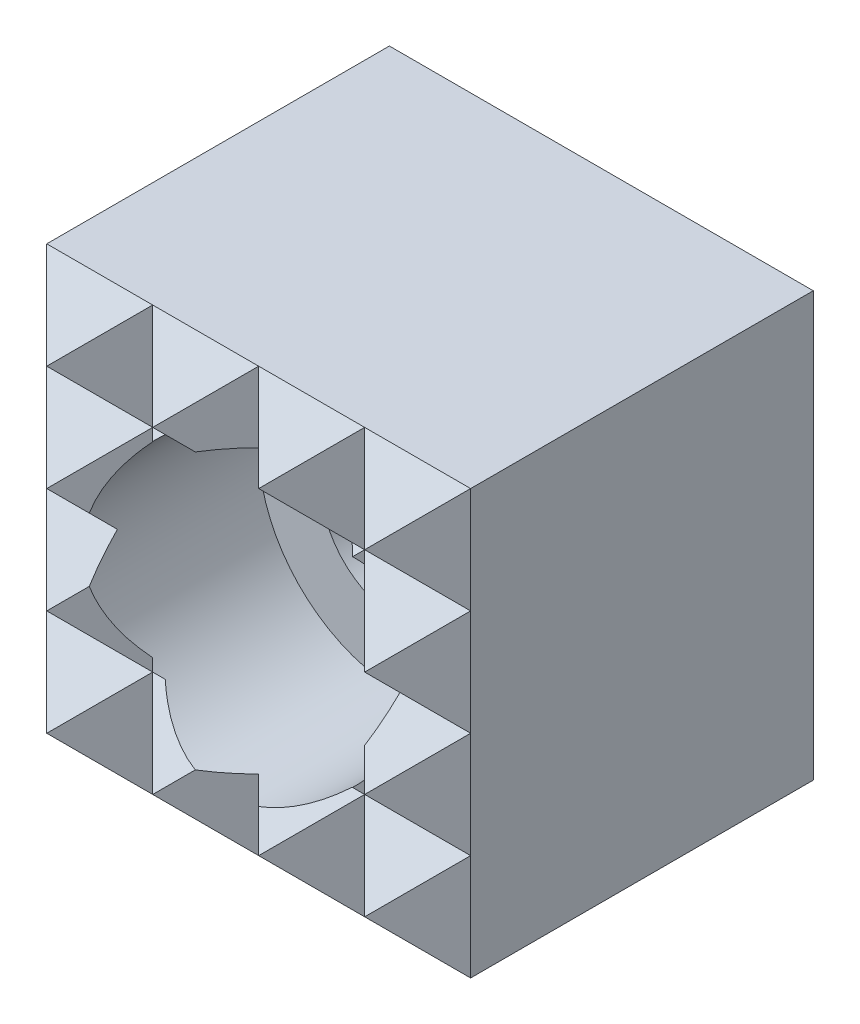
ISO-10303-21;
HEADER;
FILE_DESCRIPTION(('STEP AP214'),'2;1');
FILE_NAME('part.step','',(''),(''),'','','');
FILE_SCHEMA(('AUTOMOTIVE_DESIGN { 1 0 10303 214 1 1 1 1 }'));
ENDSEC;
DATA;
#1=APPLICATION_CONTEXT('core data for automotive mechanical design processes');
#2=APPLICATION_PROTOCOL_DEFINITION('international standard','automotive_design',2000,#1);
#3=PRODUCT_CONTEXT('',#1,'mechanical');
#4=PRODUCT('Part','Part','',(#3));
#5=PRODUCT_RELATED_PRODUCT_CATEGORY('part','',(#4));
#6=PRODUCT_DEFINITION_FORMATION('','',#4);
#7=PRODUCT_DEFINITION_CONTEXT('part definition',#1,'design');
#8=PRODUCT_DEFINITION('design','',#6,#7);
#9=PRODUCT_DEFINITION_SHAPE('','',#8);
#10=(LENGTH_UNIT() NAMED_UNIT(*) SI_UNIT(.MILLI.,.METRE.));
#11=(NAMED_UNIT(*) PLANE_ANGLE_UNIT() SI_UNIT($,.RADIAN.));
#12=(NAMED_UNIT(*) SI_UNIT($,.STERADIAN.) SOLID_ANGLE_UNIT());
#13=UNCERTAINTY_MEASURE_WITH_UNIT(LENGTH_MEASURE(1.E-05),#10,'distance_accuracy_value','');
#14=(GEOMETRIC_REPRESENTATION_CONTEXT(3) GLOBAL_UNCERTAINTY_ASSIGNED_CONTEXT((#13)) GLOBAL_UNIT_ASSIGNED_CONTEXT((#10,
#11,#12)) REPRESENTATION_CONTEXT('',''));
#15=CARTESIAN_POINT('',(0.,0.,0.));
#16=DIRECTION('',(0.,0.,1.));
#17=DIRECTION('',(1.,0.,0.));
#18=AXIS2_PLACEMENT_3D('',#15,#16,#17);
#19=CARTESIAN_POINT('',(-2.99999999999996,-10.,10.5));
#20=DIRECTION('',(0.707106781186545,0.,-0.70710678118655));
#21=DIRECTION('',(-0.70710678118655,0.,-0.707106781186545));
#22=AXIS2_PLACEMENT_3D('',#19,#20,#21);
#23=PLANE('',#22);
#24=DIRECTION('',(0.,1.,0.));
#25=VECTOR('',#24,1.);
#26=CARTESIAN_POINT('',(-2.99999999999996,-10.,10.5));
#27=LINE('',#26,#25);
#28=CARTESIAN_POINT('',(-2.99999999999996,-3.,10.5));
#29=VERTEX_POINT('',#28);
#30=CARTESIAN_POINT('',(-2.99999999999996,-2.64575131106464,10.5));
#31=VERTEX_POINT('',#30);
#32=EDGE_CURVE('E282',#29,#31,#27,.T.);
#33=ORIENTED_EDGE('',*,*,#32,.F.);
#34=DIRECTION('',(0.577350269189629,0.577350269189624,0.577350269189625));
#35=VECTOR('',#34,1.);
#36=CARTESIAN_POINT('',(-5.3333333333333,-5.33333333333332,8.16666666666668));
#37=LINE('',#36,#35);
#38=CARTESIAN_POINT('',(-2.82842712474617,-2.82842712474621,10.6715728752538));
#39=VERTEX_POINT('',#38);
#40=EDGE_CURVE('E400',#29,#39,#37,.T.);
#41=ORIENTED_EDGE('',*,*,#40,.T.);
#42=CARTESIAN_POINT('',(0.,0.,13.5));
#43=DIRECTION('',(0.707106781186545,0.,-0.70710678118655));
#44=DIRECTION('',(0.70710678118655,0.,0.707106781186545));
#45=AXIS2_PLACEMENT_3D('',#42,#43,#44);
#46=ELLIPSE('',#45,5.65685424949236,4.);
#47=EDGE_CURVE('E341',#39,#31,#46,.T.);
#48=ORIENTED_EDGE('',*,*,#47,.T.);
#49=EDGE_LOOP('',(#33,#41,#48));
#50=FACE_BOUND('',#49,.T.);
#51=ADVANCED_FACE('F14',(#50),#23,.F.);
#52=CARTESIAN_POINT('',(1.5,-10.,12.));
#53=DIRECTION('',(-0.707106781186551,0.,-0.707106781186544));
#54=DIRECTION('',(-0.707106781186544,0.,0.707106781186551));
#55=AXIS2_PLACEMENT_3D('',#52,#53,#54);
#56=PLANE('',#55);
#57=DIRECTION('',(0.,1.,0.));
#58=VECTOR('',#57,1.);
#59=CARTESIAN_POINT('',(3.,-10.,10.5));
#60=LINE('',#59,#58);
#61=CARTESIAN_POINT('',(3.,2.64575131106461,10.5));
#62=VERTEX_POINT('',#61);
#63=CARTESIAN_POINT('',(3.,3.,10.5));
#64=VERTEX_POINT('',#63);
#65=EDGE_CURVE('E702',#62,#64,#60,.T.);
#66=ORIENTED_EDGE('',*,*,#65,.T.);
#67=DIRECTION('',(-0.577350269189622,-0.577350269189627,0.577350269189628));
#68=VECTOR('',#67,1.);
#69=CARTESIAN_POINT('',(-2.33333333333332,-2.33333333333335,15.8333333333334));
#70=LINE('',#69,#68);
#71=CARTESIAN_POINT('',(2.82842712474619,2.8284271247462,10.6715728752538));
#72=VERTEX_POINT('',#71);
#73=EDGE_CURVE('E421',#64,#72,#70,.T.);
#74=ORIENTED_EDGE('',*,*,#73,.T.);
#75=CARTESIAN_POINT('',(0.,0.,13.5));
#76=DIRECTION('',(-0.707106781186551,0.,-0.707106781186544));
#77=DIRECTION('',(-0.707106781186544,0.,0.707106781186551));
#78=AXIS2_PLACEMENT_3D('',#75,#76,#77);
#79=ELLIPSE('',#78,5.65685424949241,4.);
#80=EDGE_CURVE('E353',#72,#62,#79,.T.);
#81=ORIENTED_EDGE('',*,*,#80,.T.);
#82=EDGE_LOOP('',(#66,#74,#81));
#83=FACE_BOUND('',#82,.T.);
#84=ADVANCED_FACE('F578',(#83),#56,.F.);
#85=CARTESIAN_POINT('',(-2.99999999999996,2.64575131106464,10.5));
#86=VERTEX_POINT('',#85);
#87=CARTESIAN_POINT('',(-2.82842712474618,2.82842712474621,10.6715728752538));
#88=VERTEX_POINT('',#87);
#89=EDGE_CURVE('E338',#86,#88,#46,.T.);
#90=ORIENTED_EDGE('',*,*,#89,.T.);
#91=DIRECTION('',(-0.577350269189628,0.577350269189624,-0.577350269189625));
#92=VECTOR('',#91,1.);
#93=CARTESIAN_POINT('',(1.33333333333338,-1.33333333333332,14.8333333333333));
#94=LINE('',#93,#92);
#95=CARTESIAN_POINT('',(-2.99999999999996,3.,10.5));
#96=VERTEX_POINT('',#95);
#97=EDGE_CURVE('E257',#88,#96,#94,.T.);
#98=ORIENTED_EDGE('',*,*,#97,.T.);
#99=EDGE_CURVE('E279',#86,#96,#27,.T.);
#100=ORIENTED_EDGE('',*,*,#99,.F.);
#101=EDGE_LOOP('',(#90,#98,#100));
#102=FACE_BOUND('',#101,.T.);
#103=ADVANCED_FACE('F575',(#102),#23,.F.);
#104=CARTESIAN_POINT('',(3.,-2.64575131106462,10.5));
#105=VERTEX_POINT('',#104);
#106=CARTESIAN_POINT('',(2.82842712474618,-2.8284271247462,10.6715728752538));
#107=VERTEX_POINT('',#106);
#108=EDGE_CURVE('E350',#105,#107,#79,.T.);
#109=ORIENTED_EDGE('',*,*,#108,.T.);
#110=DIRECTION('',(0.577350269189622,-0.577350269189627,-0.577350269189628));
#111=VECTOR('',#110,1.);
#112=CARTESIAN_POINT('',(4.33333333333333,-4.33333333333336,9.16666666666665));
#113=LINE('',#112,#111);
#114=CARTESIAN_POINT('',(3.,-3.,10.5));
#115=VERTEX_POINT('',#114);
#116=EDGE_CURVE('E465',#107,#115,#113,.T.);
#117=ORIENTED_EDGE('',*,*,#116,.T.);
#118=EDGE_CURVE('E704',#115,#105,#60,.T.);
#119=ORIENTED_EDGE('',*,*,#118,.T.);
#120=EDGE_LOOP('',(#109,#117,#119));
#121=FACE_BOUND('',#120,.T.);
#122=ADVANCED_FACE('F577',(#121),#56,.F.);
#123=CARTESIAN_POINT('',(3.,-10.,10.5));
#124=DIRECTION('',(0.707106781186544,0.,-0.707106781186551));
#125=DIRECTION('',(-0.707106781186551,0.,-0.707106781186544));
#126=AXIS2_PLACEMENT_3D('',#123,#124,#125);
#127=PLANE('',#126);
#128=DIRECTION('',(0.57735026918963,0.577350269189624,0.577350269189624));
#129=VECTOR('',#128,1.);
#130=CARTESIAN_POINT('',(0.666666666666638,-5.33333333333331,8.16666666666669));
#131=LINE('',#130,#129);
#132=CARTESIAN_POINT('',(4.49999999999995,-1.5,12.));
#133=VERTEX_POINT('',#132);
#134=EDGE_CURVE('E468',#115,#133,#131,.T.);
#135=ORIENTED_EDGE('',*,*,#134,.T.);
#136=DIRECTION('',(-0.57735026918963,0.577350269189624,-0.577350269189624));
#137=VECTOR('',#136,1.);
#138=CARTESIAN_POINT('',(6.33333333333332,-3.33333333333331,13.8333333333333));
#139=LINE('',#138,#137);
#140=CARTESIAN_POINT('',(3.89791576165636,-0.897915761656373,11.3979157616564));
#141=VERTEX_POINT('',#140);
#142=EDGE_CURVE('E453',#133,#141,#139,.T.);
#143=ORIENTED_EDGE('',*,*,#142,.T.);
#144=CARTESIAN_POINT('',(0.,0.,7.5));
#145=DIRECTION('',(0.707106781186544,0.,-0.707106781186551));
#146=DIRECTION('',(0.707106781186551,0.,0.707106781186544));
#147=AXIS2_PLACEMENT_3D('',#144,#145,#146);
#148=ELLIPSE('',#147,5.65685424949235,4.);
#149=EDGE_CURVE('E357',#141,#105,#148,.T.);
#150=ORIENTED_EDGE('',*,*,#149,.T.);
#151=ORIENTED_EDGE('',*,*,#118,.F.);
#152=EDGE_LOOP('',(#135,#143,#150,#151));
#153=FACE_BOUND('',#152,.T.);
#154=ADVANCED_FACE('F586',(#153),#127,.F.);
#155=CARTESIAN_POINT('',(3.89791576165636,0.897915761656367,11.3979157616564));
#156=VERTEX_POINT('',#155);
#157=EDGE_CURVE('E354',#62,#156,#148,.T.);
#158=ORIENTED_EDGE('',*,*,#157,.T.);
#159=DIRECTION('',(0.57735026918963,0.577350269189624,0.577350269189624));
#160=VECTOR('',#159,1.);
#161=CARTESIAN_POINT('',(-0.333333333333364,-3.33333333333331,7.16666666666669));
#162=LINE('',#161,#160);
#163=CARTESIAN_POINT('',(4.49999999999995,1.5,12.));
#164=VERTEX_POINT('',#163);
#165=EDGE_CURVE('E443',#156,#164,#162,.T.);
#166=ORIENTED_EDGE('',*,*,#165,.T.);
#167=DIRECTION('',(-0.57735026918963,0.577350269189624,-0.577350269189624));
#168=VECTOR('',#167,1.);
#169=CARTESIAN_POINT('',(7.33333333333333,-1.33333333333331,14.8333333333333));
#170=LINE('',#169,#168);
#171=EDGE_CURVE('E429',#164,#64,#170,.T.);
#172=ORIENTED_EDGE('',*,*,#171,.T.);
#173=ORIENTED_EDGE('',*,*,#65,.F.);
#174=EDGE_LOOP('',(#158,#166,#172,#173));
#175=FACE_BOUND('',#174,.T.);
#176=ADVANCED_FACE('F764',(#175),#127,.F.);
#177=CARTESIAN_POINT('',(4.5,-10.,12.));
#178=DIRECTION('',(-0.707106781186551,0.,-0.707106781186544));
#179=DIRECTION('',(-0.707106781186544,0.,0.707106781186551));
#180=AXIS2_PLACEMENT_3D('',#177,#178,#179);
#181=PLANE('',#180);
#182=DIRECTION('',(-0.577350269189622,-0.577350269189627,0.577350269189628));
#183=VECTOR('',#182,1.);
#184=CARTESIAN_POINT('',(2.66666666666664,-6.33333333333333,13.8333333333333));
#185=LINE('',#184,#183);
#186=CARTESIAN_POINT('',(6.,-3.,10.5));
#187=VERTEX_POINT('',#186);
#188=CARTESIAN_POINT('',(4.5,-4.5,12.));
#189=VERTEX_POINT('',#188);
#190=EDGE_CURVE('E486',#187,#189,#185,.T.);
#191=ORIENTED_EDGE('',*,*,#190,.T.);
#192=DIRECTION('',(0.577350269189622,-0.577350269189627,-0.577350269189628));
#193=VECTOR('',#192,1.);
#194=CARTESIAN_POINT('',(6.33333333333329,-6.33333333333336,10.1666666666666));
#195=LINE('',#194,#193);
#196=CARTESIAN_POINT('',(6.,-6.,10.5));
#197=VERTEX_POINT('',#196);
#198=EDGE_CURVE('E494',#189,#197,#195,.T.);
#199=ORIENTED_EDGE('',*,*,#198,.T.);
#200=DIRECTION('',(0.,1.,0.));
#201=VECTOR('',#200,1.);
#202=CARTESIAN_POINT('',(6.,-10.,10.5));
#203=LINE('',#202,#201);
#204=EDGE_CURVE('E277',#197,#187,#203,.T.);
#205=ORIENTED_EDGE('',*,*,#204,.T.);
#206=EDGE_LOOP('',(#191,#199,#205));
#207=FACE_BOUND('',#206,.T.);
#208=ADVANCED_FACE('F735',(#207),#181,.F.);
#209=DIRECTION('',(-0.577350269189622,-0.577350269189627,0.577350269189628));
#210=VECTOR('',#209,1.);
#211=CARTESIAN_POINT('',(1.66666666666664,-4.33333333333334,14.8333333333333));
#212=LINE('',#211,#210);
#213=CARTESIAN_POINT('',(6.,0.,10.5));
#214=VERTEX_POINT('',#213);
#215=EDGE_CURVE('E456',#214,#133,#212,.T.);
#216=ORIENTED_EDGE('',*,*,#215,.T.);
#217=DIRECTION('',(0.577350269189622,-0.577350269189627,-0.577350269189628));
#218=VECTOR('',#217,1.);
#219=CARTESIAN_POINT('',(7.33333333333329,-4.33333333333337,9.16666666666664));
#220=LINE('',#219,#218);
#221=EDGE_CURVE('E471',#133,#187,#220,.T.);
#222=ORIENTED_EDGE('',*,*,#221,.T.);
#223=EDGE_CURVE('E696',#187,#214,#203,.T.);
#224=ORIENTED_EDGE('',*,*,#223,.T.);
#225=EDGE_LOOP('',(#216,#222,#224));
#226=FACE_BOUND('',#225,.T.);
#227=ADVANCED_FACE('F776',(#226),#181,.F.);
#228=DIRECTION('',(-0.577350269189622,-0.577350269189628,0.577350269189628));
#229=VECTOR('',#228,1.);
#230=CARTESIAN_POINT('',(0.666666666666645,-2.33333333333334,15.8333333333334));
#231=LINE('',#230,#229);
#232=CARTESIAN_POINT('',(5.99999999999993,3.,10.5));
#233=VERTEX_POINT('',#232);
#234=EDGE_CURVE('E433',#233,#164,#231,.T.);
#235=ORIENTED_EDGE('',*,*,#234,.T.);
#236=DIRECTION('',(0.577350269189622,-0.577350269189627,-0.577350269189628));
#237=VECTOR('',#236,1.);
#238=CARTESIAN_POINT('',(8.33333333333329,-2.33333333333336,8.16666666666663));
#239=LINE('',#238,#237);
#240=EDGE_CURVE('E446',#164,#214,#239,.T.);
#241=ORIENTED_EDGE('',*,*,#240,.T.);
#242=EDGE_CURVE('E693',#214,#233,#203,.T.);
#243=ORIENTED_EDGE('',*,*,#242,.T.);
#244=EDGE_LOOP('',(#235,#241,#243));
#245=FACE_BOUND('',#244,.T.);
#246=ADVANCED_FACE('F695',(#245),#181,.F.);
#247=CARTESIAN_POINT('',(-6.,-10.,10.5));
#248=DIRECTION('',(0.707106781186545,0.,-0.70710678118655));
#249=DIRECTION('',(-0.70710678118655,0.,-0.707106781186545));
#250=AXIS2_PLACEMENT_3D('',#247,#248,#249);
#251=PLANE('',#250);
#252=DIRECTION('',(0.,1.,0.));
#253=VECTOR('',#252,1.);
#254=CARTESIAN_POINT('',(-6.,-10.,10.5));
#255=LINE('',#254,#253);
#256=CARTESIAN_POINT('',(-6.,-6.,10.5));
#257=VERTEX_POINT('',#256);
#258=CARTESIAN_POINT('',(-6.,-3.,10.5));
#259=VERTEX_POINT('',#258);
#260=EDGE_CURVE('E268',#257,#259,#255,.T.);
#261=ORIENTED_EDGE('',*,*,#260,.F.);
#262=DIRECTION('',(0.577350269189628,0.577350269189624,0.577350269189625));
#263=VECTOR('',#262,1.);
#264=CARTESIAN_POINT('',(-7.33333333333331,-7.33333333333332,9.16666666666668));
#265=LINE('',#264,#263);
#266=CARTESIAN_POINT('',(-4.49999999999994,-4.5,12.));
#267=VERTEX_POINT('',#266);
#268=EDGE_CURVE('E509',#257,#267,#265,.T.);
#269=ORIENTED_EDGE('',*,*,#268,.T.);
#270=DIRECTION('',(-0.577350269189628,0.577350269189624,-0.577350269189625));
#271=VECTOR('',#270,1.);
#272=CARTESIAN_POINT('',(-3.66666666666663,-5.33333333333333,12.8333333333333));
#273=LINE('',#272,#271);
#274=EDGE_CURVE('E393',#267,#259,#273,.T.);
#275=ORIENTED_EDGE('',*,*,#274,.T.);
#276=EDGE_LOOP('',(#261,#269,#275));
#277=FACE_BOUND('',#276,.T.);
#278=ADVANCED_FACE('F880',(#277),#251,.F.);
#279=CARTESIAN_POINT('',(-6.,0.,10.5));
#280=VERTEX_POINT('',#279);
#281=EDGE_CURVE('E273',#259,#280,#255,.T.);
#282=ORIENTED_EDGE('',*,*,#281,.F.);
#283=DIRECTION('',(0.577350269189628,0.577350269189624,0.577350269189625));
#284=VECTOR('',#283,1.);
#285=CARTESIAN_POINT('',(-8.33333333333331,-5.33333333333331,8.16666666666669));
#286=LINE('',#285,#284);
#287=CARTESIAN_POINT('',(-4.49999999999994,-1.5,12.));
#288=VERTEX_POINT('',#287);
#289=EDGE_CURVE('E381',#259,#288,#286,.T.);
#290=ORIENTED_EDGE('',*,*,#289,.T.);
#291=DIRECTION('',(-0.577350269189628,0.577350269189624,-0.577350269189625));
#292=VECTOR('',#291,1.);
#293=CARTESIAN_POINT('',(-2.66666666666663,-3.33333333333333,13.8333333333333));
#294=LINE('',#293,#292);
#295=EDGE_CURVE('E461',#288,#280,#294,.T.);
#296=ORIENTED_EDGE('',*,*,#295,.T.);
#297=EDGE_LOOP('',(#282,#290,#296));
#298=FACE_BOUND('',#297,.T.);
#299=ADVANCED_FACE('F1179',(#298),#251,.F.);
#300=CARTESIAN_POINT('',(-6.,3.,10.5));
#301=VERTEX_POINT('',#300);
#302=EDGE_CURVE('E254',#280,#301,#255,.T.);
#303=ORIENTED_EDGE('',*,*,#302,.F.);
#304=DIRECTION('',(0.577350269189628,0.577350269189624,0.577350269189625));
#305=VECTOR('',#304,1.);
#306=CARTESIAN_POINT('',(-9.33333333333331,-3.33333333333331,7.16666666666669));
#307=LINE('',#306,#305);
#308=CARTESIAN_POINT('',(-4.49999999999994,1.5,12.));
#309=VERTEX_POINT('',#308);
#310=EDGE_CURVE('E256',#280,#309,#307,.T.);
#311=ORIENTED_EDGE('',*,*,#310,.T.);
#312=DIRECTION('',(-0.577350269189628,0.577350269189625,-0.577350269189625));
#313=VECTOR('',#312,1.);
#314=CARTESIAN_POINT('',(-1.66666666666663,-1.33333333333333,14.8333333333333));
#315=LINE('',#314,#313);
#316=EDGE_CURVE('E241',#309,#301,#315,.T.);
#317=ORIENTED_EDGE('',*,*,#316,.T.);
#318=EDGE_LOOP('',(#303,#311,#317));
#319=FACE_BOUND('',#318,.T.);
#320=ADVANCED_FACE('F252',(#319),#251,.F.);
#321=CARTESIAN_POINT('',(-4.49999999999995,-10.,12.));
#322=DIRECTION('',(-0.70710678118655,0.,-0.707106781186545));
#323=DIRECTION('',(-0.707106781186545,0.,0.70710678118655));
#324=AXIS2_PLACEMENT_3D('',#321,#322,#323);
#325=PLANE('',#324);
#326=CARTESIAN_POINT('',(0.,0.,7.5));
#327=DIRECTION('',(-0.70710678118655,0.,-0.707106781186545));
#328=DIRECTION('',(-0.707106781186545,0.,0.70710678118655));
#329=AXIS2_PLACEMENT_3D('',#326,#327,#328);
#330=ELLIPSE('',#329,5.6568542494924,4.);
#331=CARTESIAN_POINT('',(-3.89791576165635,-0.897915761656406,11.3979157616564));
#332=VERTEX_POINT('',#331);
#333=EDGE_CURVE('E335',#31,#332,#330,.T.);
#334=ORIENTED_EDGE('',*,*,#333,.T.);
#335=DIRECTION('',(-0.577350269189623,-0.577350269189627,0.577350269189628));
#336=VECTOR('',#335,1.);
#337=CARTESIAN_POINT('',(-7.33333333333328,-4.33333333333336,14.8333333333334));
#338=LINE('',#337,#336);
#339=EDGE_CURVE('E9',#332,#288,#338,.T.);
#340=ORIENTED_EDGE('',*,*,#339,.T.);
#341=DIRECTION('',(0.577350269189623,-0.577350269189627,-0.577350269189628));
#342=VECTOR('',#341,1.);
#343=CARTESIAN_POINT('',(-1.66666666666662,-4.33333333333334,9.16666666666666));
#344=LINE('',#343,#342);
#345=EDGE_CURVE('E22',#288,#29,#344,.T.);
#346=ORIENTED_EDGE('',*,*,#345,.T.);
#347=ORIENTED_EDGE('',*,*,#32,.T.);
#348=EDGE_LOOP('',(#334,#340,#346,#347));
#349=FACE_BOUND('',#348,.T.);
#350=ADVANCED_FACE('F374',(#349),#325,.F.);
#351=DIRECTION('',(-0.577350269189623,-0.577350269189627,0.577350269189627));
#352=VECTOR('',#351,1.);
#353=CARTESIAN_POINT('',(-8.33333333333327,-2.33333333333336,15.8333333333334));
#354=LINE('',#353,#352);
#355=EDGE_CURVE('E244',#96,#309,#354,.T.);
#356=ORIENTED_EDGE('',*,*,#355,.T.);
#357=DIRECTION('',(0.577350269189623,-0.577350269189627,-0.577350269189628));
#358=VECTOR('',#357,1.);
#359=CARTESIAN_POINT('',(-0.666666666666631,-2.33333333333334,8.16666666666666));
#360=LINE('',#359,#358);
#361=CARTESIAN_POINT('',(-3.89791576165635,0.897915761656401,11.3979157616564));
#362=VERTEX_POINT('',#361);
#363=EDGE_CURVE('E362',#309,#362,#360,.T.);
#364=ORIENTED_EDGE('',*,*,#363,.T.);
#365=EDGE_CURVE('E323',#362,#86,#330,.T.);
#366=ORIENTED_EDGE('',*,*,#365,.T.);
#367=ORIENTED_EDGE('',*,*,#99,.T.);
#368=EDGE_LOOP('',(#356,#364,#366,#367));
#369=FACE_BOUND('',#368,.T.);
#370=ADVANCED_FACE('F574',(#369),#325,.F.);
#371=CARTESIAN_POINT('',(-6.,-6.,0.));
#372=DIRECTION('',(0.,0.,-1.));
#373=DIRECTION('',(-1.,0.,0.));
#374=AXIS2_PLACEMENT_3D('',#371,#372,#373);
#375=PLANE('',#374);
#376=DIRECTION('',(0.,-1.,0.));
#377=VECTOR('',#376,1.);
#378=CARTESIAN_POINT('',(5.2,-6.,0.));
#379=LINE('',#378,#377);
#380=CARTESIAN_POINT('',(5.2,5.2,0.));
#381=VERTEX_POINT('',#380);
#382=CARTESIAN_POINT('',(5.2,-5.2,0.));
#383=VERTEX_POINT('',#382);
#384=EDGE_CURVE('E302',#381,#383,#379,.T.);
#385=ORIENTED_EDGE('',*,*,#384,.T.);
#386=DIRECTION('',(-1.,0.,0.));
#387=VECTOR('',#386,1.);
#388=CARTESIAN_POINT('',(-6.,-5.2,0.));
#389=LINE('',#388,#387);
#390=CARTESIAN_POINT('',(-5.2,-5.2,0.));
#391=VERTEX_POINT('',#390);
#392=EDGE_CURVE('E308',#383,#391,#389,.T.);
#393=ORIENTED_EDGE('',*,*,#392,.T.);
#394=DIRECTION('',(0.,1.,0.));
#395=VECTOR('',#394,1.);
#396=CARTESIAN_POINT('',(-5.2,6.,0.));
#397=LINE('',#396,#395);
#398=CARTESIAN_POINT('',(-5.2,5.2,0.));
#399=VERTEX_POINT('',#398);
#400=EDGE_CURVE('E306',#391,#399,#397,.T.);
#401=ORIENTED_EDGE('',*,*,#400,.T.);
#402=DIRECTION('',(1.,0.,0.));
#403=VECTOR('',#402,1.);
#404=CARTESIAN_POINT('',(-6.,5.2,0.));
#405=LINE('',#404,#403);
#406=EDGE_CURVE('E304',#399,#381,#405,.T.);
#407=ORIENTED_EDGE('',*,*,#406,.T.);
#408=EDGE_LOOP('',(#385,#393,#401,#407));
#409=FACE_BOUND('',#408,.T.);
#410=CARTESIAN_POINT('',(0.,0.,0.));
#411=DIRECTION('',(0.,0.,1.));
#412=DIRECTION('',(1.,0.,0.));
#413=AXIS2_PLACEMENT_3D('',#410,#411,#412);
#414=CIRCLE('',#413,2.25);
#415=CARTESIAN_POINT('',(2.25,0.,0.));
#416=VERTEX_POINT('',#415);
#417=EDGE_CURVE('E284',#416,#416,#414,.T.);
#418=ORIENTED_EDGE('',*,*,#417,.T.);
#419=EDGE_LOOP('',(#418));
#420=FACE_BOUND('',#419,.T.);
#421=ADVANCED_FACE('F796',(#409,#420),#375,.T.);
#422=CARTESIAN_POINT('',(-6.,6.,12.));
#423=DIRECTION('',(1.,0.,0.));
#424=DIRECTION('',(0.,1.,0.));
#425=AXIS2_PLACEMENT_3D('',#422,#423,#424);
#426=PLANE('',#425);
#427=DIRECTION('',(0.,0.,-1.));
#428=VECTOR('',#427,1.);
#429=CARTESIAN_POINT('',(-6.,-6.,12.));
#430=LINE('',#429,#428);
#431=CARTESIAN_POINT('',(-6.,-6.,0.8));
#432=VERTEX_POINT('',#431);
#433=EDGE_CURVE('E300',#257,#432,#430,.T.);
#434=ORIENTED_EDGE('',*,*,#433,.F.);
#435=ORIENTED_EDGE('',*,*,#260,.T.);
#436=ORIENTED_EDGE('',*,*,#281,.T.);
#437=ORIENTED_EDGE('',*,*,#302,.T.);
#438=CARTESIAN_POINT('',(-6.,6.,10.5));
#439=VERTEX_POINT('',#438);
#440=EDGE_CURVE('E261',#301,#439,#255,.T.);
#441=ORIENTED_EDGE('',*,*,#440,.T.);
#442=DIRECTION('',(0.,0.,-1.));
#443=VECTOR('',#442,1.);
#444=CARTESIAN_POINT('',(-6.,6.,12.));
#445=LINE('',#444,#443);
#446=CARTESIAN_POINT('',(-6.,6.,0.8));
#447=VERTEX_POINT('',#446);
#448=EDGE_CURVE('E294',#439,#447,#445,.T.);
#449=ORIENTED_EDGE('',*,*,#448,.T.);
#450=DIRECTION('',(0.,-1.,0.));
#451=VECTOR('',#450,1.);
#452=CARTESIAN_POINT('',(-6.,-6.,0.8));
#453=LINE('',#452,#451);
#454=EDGE_CURVE('E314',#447,#432,#453,.T.);
#455=ORIENTED_EDGE('',*,*,#454,.T.);
#456=EDGE_LOOP('',(#434,#435,#436,#437,#441,#449,#455));
#457=FACE_BOUND('',#456,.T.);
#458=ADVANCED_FACE('F270',(#457),#426,.F.);
#459=CARTESIAN_POINT('',(6.,-6.,12.));
#460=DIRECTION('',(0.,-1.,0.));
#461=DIRECTION('',(1.,0.,0.));
#462=AXIS2_PLACEMENT_3D('',#459,#460,#461);
#463=PLANE('',#462);
#464=DIRECTION('',(1.,0.,0.));
#465=VECTOR('',#464,1.);
#466=CARTESIAN_POINT('',(-10.,-6.,10.5));
#467=LINE('',#466,#465);
#468=CARTESIAN_POINT('',(-2.99999999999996,-6.,10.5));
#469=VERTEX_POINT('',#468);
#470=EDGE_CURVE('E555',#257,#469,#467,.T.);
#471=ORIENTED_EDGE('',*,*,#470,.F.);
#472=ORIENTED_EDGE('',*,*,#433,.T.);
#473=DIRECTION('',(1.,0.,0.));
#474=VECTOR('',#473,1.);
#475=CARTESIAN_POINT('',(6.,-6.,0.8));
#476=LINE('',#475,#474);
#477=CARTESIAN_POINT('',(6.,-6.,0.8));
#478=VERTEX_POINT('',#477);
#479=EDGE_CURVE('E311',#432,#478,#476,.T.);
#480=ORIENTED_EDGE('',*,*,#479,.T.);
#481=DIRECTION('',(0.,0.,-1.));
#482=VECTOR('',#481,1.);
#483=CARTESIAN_POINT('',(6.,-6.,12.));
#484=LINE('',#483,#482);
#485=EDGE_CURVE('E298',#197,#478,#484,.T.);
#486=ORIENTED_EDGE('',*,*,#485,.F.);
#487=CARTESIAN_POINT('',(3.,-6.,10.5));
#488=VERTEX_POINT('',#487);
#489=EDGE_CURVE('E553',#488,#197,#467,.T.);
#490=ORIENTED_EDGE('',*,*,#489,.F.);
#491=CARTESIAN_POINT('',(0.,-6.,10.5));
#492=VERTEX_POINT('',#491);
#493=EDGE_CURVE('E554',#492,#488,#467,.T.);
#494=ORIENTED_EDGE('',*,*,#493,.F.);
#495=EDGE_CURVE('E750',#469,#492,#467,.T.);
#496=ORIENTED_EDGE('',*,*,#495,.F.);
#497=EDGE_LOOP('',(#471,#472,#480,#486,#490,#494,#496));
#498=FACE_BOUND('',#497,.T.);
#499=ADVANCED_FACE('F744',(#498),#463,.T.);
#500=CARTESIAN_POINT('',(6.,-6.,12.));
#501=DIRECTION('',(-1.,0.,0.));
#502=DIRECTION('',(0.,0.,1.));
#503=AXIS2_PLACEMENT_3D('',#500,#501,#502);
#504=PLANE('',#503);
#505=DIRECTION('',(0.,0.,-1.));
#506=VECTOR('',#505,1.);
#507=CARTESIAN_POINT('',(6.,6.,12.));
#508=LINE('',#507,#506);
#509=CARTESIAN_POINT('',(6.,6.,10.5));
#510=VERTEX_POINT('',#509);
#511=CARTESIAN_POINT('',(6.,6.,0.8));
#512=VERTEX_POINT('',#511);
#513=EDGE_CURVE('E296',#510,#512,#508,.T.);
#514=ORIENTED_EDGE('',*,*,#513,.F.);
#515=EDGE_CURVE('E276',#233,#510,#203,.T.);
#516=ORIENTED_EDGE('',*,*,#515,.F.);
#517=ORIENTED_EDGE('',*,*,#242,.F.);
#518=ORIENTED_EDGE('',*,*,#223,.F.);
#519=ORIENTED_EDGE('',*,*,#204,.F.);
#520=ORIENTED_EDGE('',*,*,#485,.T.);
#521=DIRECTION('',(0.,1.,0.));
#522=VECTOR('',#521,1.);
#523=CARTESIAN_POINT('',(6.,6.,0.8));
#524=LINE('',#523,#522);
#525=EDGE_CURVE('E320',#478,#512,#524,.T.);
#526=ORIENTED_EDGE('',*,*,#525,.T.);
#527=EDGE_LOOP('',(#514,#516,#517,#518,#519,#520,#526));
#528=FACE_BOUND('',#527,.T.);
#529=ADVANCED_FACE('F691',(#528),#504,.F.);
#530=CARTESIAN_POINT('',(-6.,6.,12.));
#531=DIRECTION('',(0.,1.,0.));
#532=DIRECTION('',(0.,0.,1.));
#533=AXIS2_PLACEMENT_3D('',#530,#531,#532);
#534=PLANE('',#533);
#535=DIRECTION('',(1.,0.,0.));
#536=VECTOR('',#535,1.);
#537=CARTESIAN_POINT('',(-10.,6.,10.5));
#538=LINE('',#537,#536);
#539=CARTESIAN_POINT('',(2.99999999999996,6.,10.5));
#540=VERTEX_POINT('',#539);
#541=EDGE_CURVE('E245',#540,#510,#538,.T.);
#542=ORIENTED_EDGE('',*,*,#541,.T.);
#543=ORIENTED_EDGE('',*,*,#513,.T.);
#544=DIRECTION('',(-1.,0.,0.));
#545=VECTOR('',#544,1.);
#546=CARTESIAN_POINT('',(-6.,6.,0.8));
#547=LINE('',#546,#545);
#548=EDGE_CURVE('E317',#512,#447,#547,.T.);
#549=ORIENTED_EDGE('',*,*,#548,.T.);
#550=ORIENTED_EDGE('',*,*,#448,.F.);
#551=CARTESIAN_POINT('',(-2.99999999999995,6.,10.5));
#552=VERTEX_POINT('',#551);
#553=EDGE_CURVE('E552',#439,#552,#538,.T.);
#554=ORIENTED_EDGE('',*,*,#553,.T.);
#555=CARTESIAN_POINT('',(0.,6.,10.5));
#556=VERTEX_POINT('',#555);
#557=EDGE_CURVE('E618',#552,#556,#538,.T.);
#558=ORIENTED_EDGE('',*,*,#557,.T.);
#559=EDGE_CURVE('E551',#556,#540,#538,.T.);
#560=ORIENTED_EDGE('',*,*,#559,.T.);
#561=EDGE_LOOP('',(#542,#543,#549,#550,#554,#558,#560));
#562=FACE_BOUND('',#561,.T.);
#563=ADVANCED_FACE('F630',(#562),#534,.T.);
#564=CARTESIAN_POINT('',(0.,0.,12.));
#565=DIRECTION('',(0.,0.,1.));
#566=DIRECTION('',(1.,0.,0.));
#567=AXIS2_PLACEMENT_3D('',#564,#565,#566);
#568=CYLINDRICAL_SURFACE('',#567,4.);
#569=CARTESIAN_POINT('',(0.,0.,10.5));
#570=DIRECTION('',(0.,0.707106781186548,-0.707106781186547));
#571=DIRECTION('',(0.,0.707106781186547,0.707106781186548));
#572=AXIS2_PLACEMENT_3D('',#569,#570,#571);
#573=ELLIPSE('',#572,5.65685424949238,4.);
#574=CARTESIAN_POINT('',(-4.,0.,10.5));
#575=VERTEX_POINT('',#574);
#576=EDGE_CURVE('E449',#575,#362,#573,.T.);
#577=ORIENTED_EDGE('',*,*,#576,.F.);
#578=CARTESIAN_POINT('',(0.,0.,10.5));
#579=DIRECTION('',(0.,-0.707106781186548,-0.707106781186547));
#580=DIRECTION('',(0.,-0.707106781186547,0.707106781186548));
#581=AXIS2_PLACEMENT_3D('',#578,#579,#580);
#582=ELLIPSE('',#581,5.65685424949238,4.);
#583=EDGE_CURVE('E459',#332,#575,#582,.T.);
#584=ORIENTED_EDGE('',*,*,#583,.F.);
#585=ORIENTED_EDGE('',*,*,#333,.F.);
#586=ORIENTED_EDGE('',*,*,#47,.F.);
#587=CARTESIAN_POINT('',(0.,0.,13.5));
#588=DIRECTION('',(0.,0.707106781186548,-0.707106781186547));
#589=DIRECTION('',(0.,0.707106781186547,0.707106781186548));
#590=AXIS2_PLACEMENT_3D('',#587,#588,#589);
#591=ELLIPSE('',#590,5.65685424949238,4.);
#592=CARTESIAN_POINT('',(-2.64575131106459,-3.,10.5));
#593=VERTEX_POINT('',#592);
#594=EDGE_CURVE('E404',#593,#39,#591,.T.);
#595=ORIENTED_EDGE('',*,*,#594,.F.);
#596=CARTESIAN_POINT('',(0.,0.,7.5));
#597=DIRECTION('',(0.,-0.707106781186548,-0.707106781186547));
#598=DIRECTION('',(0.,-0.707106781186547,0.707106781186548));
#599=AXIS2_PLACEMENT_3D('',#596,#597,#598);
#600=ELLIPSE('',#599,5.65685424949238,4.);
#601=CARTESIAN_POINT('',(-0.89791576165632,-3.89791576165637,11.3979157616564));
#602=VERTEX_POINT('',#601);
#603=EDGE_CURVE('E414',#602,#593,#600,.T.);
#604=ORIENTED_EDGE('',*,*,#603,.F.);
#605=CARTESIAN_POINT('',(0.,0.,10.5));
#606=DIRECTION('',(-0.70710678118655,0.,-0.707106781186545));
#607=DIRECTION('',(-0.707106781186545,0.,0.70710678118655));
#608=AXIS2_PLACEMENT_3D('',#605,#606,#607);
#609=ELLIPSE('',#608,5.6568542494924,4.);
#610=CARTESIAN_POINT('',(0.,-4.,10.5));
#611=VERTEX_POINT('',#610);
#612=EDGE_CURVE('E342',#611,#602,#609,.T.);
#613=ORIENTED_EDGE('',*,*,#612,.F.);
#614=CARTESIAN_POINT('',(0.,0.,10.5));
#615=DIRECTION('',(0.707106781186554,0.,-0.707106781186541));
#616=DIRECTION('',(0.707106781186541,0.,0.707106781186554));
#617=AXIS2_PLACEMENT_3D('',#614,#615,#616);
#618=ELLIPSE('',#617,5.65685424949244,4.);
#619=CARTESIAN_POINT('',(0.897915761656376,-3.89791576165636,11.3979157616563));
#620=VERTEX_POINT('',#619);
#621=EDGE_CURVE('E349',#620,#611,#618,.T.);
#622=ORIENTED_EDGE('',*,*,#621,.F.);
#623=CARTESIAN_POINT('',(2.64575131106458,-3.,10.5));
#624=VERTEX_POINT('',#623);
#625=EDGE_CURVE('E476',#624,#620,#600,.T.);
#626=ORIENTED_EDGE('',*,*,#625,.F.);
#627=EDGE_CURVE('E464',#107,#624,#591,.T.);
#628=ORIENTED_EDGE('',*,*,#627,.F.);
#629=ORIENTED_EDGE('',*,*,#108,.F.);
#630=ORIENTED_EDGE('',*,*,#149,.F.);
#631=CARTESIAN_POINT('',(4.,0.,10.5));
#632=VERTEX_POINT('',#631);
#633=EDGE_CURVE('E452',#632,#141,#582,.T.);
#634=ORIENTED_EDGE('',*,*,#633,.F.);
#635=EDGE_CURVE('E258',#156,#632,#573,.T.);
#636=ORIENTED_EDGE('',*,*,#635,.F.);
#637=ORIENTED_EDGE('',*,*,#157,.F.);
#638=ORIENTED_EDGE('',*,*,#80,.F.);
#639=CARTESIAN_POINT('',(0.,0.,13.5));
#640=DIRECTION('',(0.,-0.707106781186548,-0.707106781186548));
#641=DIRECTION('',(0.,-0.707106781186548,0.707106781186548));
#642=AXIS2_PLACEMENT_3D('',#639,#640,#641);
#643=ELLIPSE('',#642,5.65685424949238,4.);
#644=CARTESIAN_POINT('',(2.6457513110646,3.,10.5));
#645=VERTEX_POINT('',#644);
#646=EDGE_CURVE('E417',#645,#72,#643,.T.);
#647=ORIENTED_EDGE('',*,*,#646,.F.);
#648=CARTESIAN_POINT('',(0.,0.,7.5));
#649=DIRECTION('',(0.,0.707106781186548,-0.707106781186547));
#650=DIRECTION('',(0.,0.707106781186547,0.707106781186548));
#651=AXIS2_PLACEMENT_3D('',#648,#649,#650);
#652=ELLIPSE('',#651,5.65685424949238,4.);
#653=CARTESIAN_POINT('',(0.897915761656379,3.89791576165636,11.3979157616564));
#654=VERTEX_POINT('',#653);
#655=EDGE_CURVE('E529',#654,#645,#652,.T.);
#656=ORIENTED_EDGE('',*,*,#655,.F.);
#657=CARTESIAN_POINT('',(0.,4.,10.5));
#658=VERTEX_POINT('',#657);
#659=EDGE_CURVE('E346',#658,#654,#618,.T.);
#660=ORIENTED_EDGE('',*,*,#659,.F.);
#661=CARTESIAN_POINT('',(-0.897915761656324,3.89791576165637,11.3979157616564));
#662=VERTEX_POINT('',#661);
#663=EDGE_CURVE('E345',#662,#658,#609,.T.);
#664=ORIENTED_EDGE('',*,*,#663,.F.);
#665=CARTESIAN_POINT('',(-2.6457513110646,3.,10.5));
#666=VERTEX_POINT('',#665);
#667=EDGE_CURVE('E542',#666,#662,#652,.T.);
#668=ORIENTED_EDGE('',*,*,#667,.F.);
#669=EDGE_CURVE('E423',#88,#666,#643,.T.);
#670=ORIENTED_EDGE('',*,*,#669,.F.);
#671=ORIENTED_EDGE('',*,*,#89,.F.);
#672=ORIENTED_EDGE('',*,*,#365,.F.);
#673=EDGE_LOOP('',(#577,#584,#585,#586,#595,#604,#613,#622,#626,#628,#629,#630,#634,#636,#637,
#638,#647,#656,#660,#664,#668,#670,#671,#672));
#674=FACE_BOUND('',#673,.T.);
#675=CARTESIAN_POINT('',(0.,0.,6.5));
#676=DIRECTION('',(0.,0.,1.));
#677=DIRECTION('',(1.,0.,0.));
#678=AXIS2_PLACEMENT_3D('',#675,#676,#677);
#679=CIRCLE('',#678,4.);
#680=CARTESIAN_POINT('',(4.,0.,6.5));
#681=VERTEX_POINT('',#680);
#682=EDGE_CURVE('E291',#681,#681,#679,.T.);
#683=ORIENTED_EDGE('',*,*,#682,.F.);
#684=EDGE_LOOP('',(#683));
#685=FACE_BOUND('',#684,.T.);
#686=ADVANCED_FACE('F570',(#674,#685),#568,.F.);
#687=CARTESIAN_POINT('',(2.25,0.,6.5));
#688=DIRECTION('',(0.,0.,1.));
#689=DIRECTION('',(1.,0.,0.));
#690=AXIS2_PLACEMENT_3D('',#687,#688,#689);
#691=PLANE('',#690);
#692=ORIENTED_EDGE('',*,*,#682,.T.);
#693=EDGE_LOOP('',(#692));
#694=FACE_BOUND('',#693,.T.);
#695=CARTESIAN_POINT('',(0.,0.,6.5));
#696=DIRECTION('',(0.,0.,1.));
#697=DIRECTION('',(1.,0.,0.));
#698=AXIS2_PLACEMENT_3D('',#695,#696,#697);
#699=CIRCLE('',#698,2.25);
#700=CARTESIAN_POINT('',(2.25,0.,6.5));
#701=VERTEX_POINT('',#700);
#702=EDGE_CURVE('E287',#701,#701,#699,.T.);
#703=ORIENTED_EDGE('',*,*,#702,.F.);
#704=EDGE_LOOP('',(#703));
#705=FACE_BOUND('',#704,.T.);
#706=ADVANCED_FACE('F805',(#694,#705),#691,.T.);
#707=CARTESIAN_POINT('',(0.,0.,12.));
#708=DIRECTION('',(0.,0.,1.));
#709=DIRECTION('',(1.,0.,0.));
#710=AXIS2_PLACEMENT_3D('',#707,#708,#709);
#711=CYLINDRICAL_SURFACE('',#710,2.25);
#712=ORIENTED_EDGE('',*,*,#702,.T.);
#713=EDGE_LOOP('',(#712));
#714=FACE_BOUND('',#713,.T.);
#715=ORIENTED_EDGE('',*,*,#417,.F.);
#716=EDGE_LOOP('',(#715));
#717=FACE_BOUND('',#716,.T.);
#718=ADVANCED_FACE('F800',(#714,#717),#711,.F.);
#719=CARTESIAN_POINT('',(-6.,5.2,0.));
#720=DIRECTION('',(0.,-0.707106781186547,0.707106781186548));
#721=DIRECTION('',(0.,-0.707106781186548,-0.707106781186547));
#722=AXIS2_PLACEMENT_3D('',#719,#720,#721);
#723=PLANE('',#722);
#724=DIRECTION('',(0.577350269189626,-0.577350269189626,-0.577350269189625));
#725=VECTOR('',#724,1.);
#726=CARTESIAN_POINT('',(-5.46666666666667,5.46666666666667,0.266666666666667));
#727=LINE('',#726,#725);
#728=EDGE_CURVE('E330',#447,#399,#727,.T.);
#729=ORIENTED_EDGE('',*,*,#728,.F.);
#730=ORIENTED_EDGE('',*,*,#548,.F.);
#731=DIRECTION('',(-0.577350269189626,-0.577350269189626,-0.577350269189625));
#732=VECTOR('',#731,1.);
#733=CARTESIAN_POINT('',(2.,2.,-3.2));
#734=LINE('',#733,#732);
#735=EDGE_CURVE('E288',#381,#512,#734,.F.);
#736=ORIENTED_EDGE('',*,*,#735,.F.);
#737=ORIENTED_EDGE('',*,*,#406,.F.);
#738=EDGE_LOOP('',(#729,#730,#736,#737));
#739=FACE_BOUND('',#738,.T.);
#740=ADVANCED_FACE('F16',(#739),#723,.F.);
#741=CARTESIAN_POINT('',(6.,-6.,0.8));
#742=DIRECTION('',(0.707106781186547,0.,-0.707106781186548));
#743=DIRECTION('',(-0.707106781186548,0.,-0.707106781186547));
#744=AXIS2_PLACEMENT_3D('',#741,#742,#743);
#745=PLANE('',#744);
#746=ORIENTED_EDGE('',*,*,#735,.T.);
#747=ORIENTED_EDGE('',*,*,#525,.F.);
#748=DIRECTION('',(0.577350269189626,-0.577350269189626,0.577350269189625));
#749=VECTOR('',#748,1.);
#750=CARTESIAN_POINT('',(6.,-6.,0.8));
#751=LINE('',#750,#749);
#752=EDGE_CURVE('E326',#383,#478,#751,.T.);
#753=ORIENTED_EDGE('',*,*,#752,.F.);
#754=ORIENTED_EDGE('',*,*,#384,.F.);
#755=EDGE_LOOP('',(#746,#747,#753,#754));
#756=FACE_BOUND('',#755,.T.);
#757=ADVANCED_FACE('F787',(#756),#745,.T.);
#758=CARTESIAN_POINT('',(-6.,6.,0.8));
#759=DIRECTION('',(-0.707106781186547,0.,-0.707106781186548));
#760=DIRECTION('',(-0.707106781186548,0.,0.707106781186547));
#761=AXIS2_PLACEMENT_3D('',#758,#759,#760);
#762=PLANE('',#761);
#763=ORIENTED_EDGE('',*,*,#728,.T.);
#764=ORIENTED_EDGE('',*,*,#400,.F.);
#765=DIRECTION('',(0.577350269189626,0.577350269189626,-0.577350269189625));
#766=VECTOR('',#765,1.);
#767=CARTESIAN_POINT('',(-2.,-2.,-3.2));
#768=LINE('',#767,#766);
#769=EDGE_CURVE('E324',#432,#391,#768,.T.);
#770=ORIENTED_EDGE('',*,*,#769,.F.);
#771=ORIENTED_EDGE('',*,*,#454,.F.);
#772=EDGE_LOOP('',(#763,#764,#770,#771));
#773=FACE_BOUND('',#772,.T.);
#774=ADVANCED_FACE('F791',(#773),#762,.T.);
#775=CARTESIAN_POINT('',(-6.,-5.2,0.));
#776=DIRECTION('',(0.,0.707106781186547,0.707106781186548));
#777=DIRECTION('',(0.,-0.707106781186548,0.707106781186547));
#778=AXIS2_PLACEMENT_3D('',#775,#776,#777);
#779=PLANE('',#778);
#780=ORIENTED_EDGE('',*,*,#752,.T.);
#781=ORIENTED_EDGE('',*,*,#479,.F.);
#782=ORIENTED_EDGE('',*,*,#769,.T.);
#783=ORIENTED_EDGE('',*,*,#392,.F.);
#784=EDGE_LOOP('',(#780,#781,#782,#783));
#785=FACE_BOUND('',#784,.T.);
#786=ADVANCED_FACE('F783',(#785),#779,.F.);
#787=CARTESIAN_POINT('',(-1.49999999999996,-10.,12.));
#788=DIRECTION('',(-0.70710678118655,0.,-0.707106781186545));
#789=DIRECTION('',(-0.707106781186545,0.,0.70710678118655));
#790=AXIS2_PLACEMENT_3D('',#787,#788,#789);
#791=PLANE('',#790);
#792=DIRECTION('',(0.,1.,0.));
#793=VECTOR('',#792,1.);
#794=CARTESIAN_POINT('',(0.,-10.,10.5));
#795=LINE('',#794,#793);
#796=EDGE_CURVE('E615',#658,#556,#795,.T.);
#797=ORIENTED_EDGE('',*,*,#796,.T.);
#798=DIRECTION('',(-0.577350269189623,-0.577350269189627,0.577350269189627));
#799=VECTOR('',#798,1.);
#800=CARTESIAN_POINT('',(-6.33333333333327,-0.333333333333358,16.8333333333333));
#801=LINE('',#800,#799);
#802=CARTESIAN_POINT('',(-1.49999999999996,4.5,12.));
#803=VERTEX_POINT('',#802);
#804=EDGE_CURVE('E522',#556,#803,#801,.T.);
#805=ORIENTED_EDGE('',*,*,#804,.T.);
#806=DIRECTION('',(0.577350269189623,-0.577350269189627,-0.577350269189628));
#807=VECTOR('',#806,1.);
#808=CARTESIAN_POINT('',(3.33333333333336,-0.333333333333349,7.16666666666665));
#809=LINE('',#808,#807);
#810=EDGE_CURVE('E29',#803,#662,#809,.T.);
#811=ORIENTED_EDGE('',*,*,#810,.T.);
#812=ORIENTED_EDGE('',*,*,#663,.T.);
#813=EDGE_LOOP('',(#797,#805,#811,#812));
#814=FACE_BOUND('',#813,.T.);
#815=ADVANCED_FACE('F612',(#814),#791,.F.);
#816=CARTESIAN_POINT('',(0.,-10.,10.5));
#817=DIRECTION('',(0.707106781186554,0.,-0.707106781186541));
#818=DIRECTION('',(-0.707106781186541,0.,-0.707106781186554));
#819=AXIS2_PLACEMENT_3D('',#816,#817,#818);
#820=PLANE('',#819);
#821=DIRECTION('',(0.577350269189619,0.577350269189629,0.57735026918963));
#822=VECTOR('',#821,1.);
#823=CARTESIAN_POINT('',(-1.33333333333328,-7.33333333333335,9.16666666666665));
#824=LINE('',#823,#822);
#825=CARTESIAN_POINT('',(1.5,-4.5,12.));
#826=VERTEX_POINT('',#825);
#827=EDGE_CURVE('E503',#492,#826,#824,.T.);
#828=ORIENTED_EDGE('',*,*,#827,.T.);
#829=DIRECTION('',(-0.577350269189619,0.577350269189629,-0.57735026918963));
#830=VECTOR('',#829,1.);
#831=CARTESIAN_POINT('',(2.33333333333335,-5.33333333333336,12.8333333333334));
#832=LINE('',#831,#830);
#833=EDGE_CURVE('E477',#826,#620,#832,.T.);
#834=ORIENTED_EDGE('',*,*,#833,.T.);
#835=ORIENTED_EDGE('',*,*,#621,.T.);
#836=EDGE_CURVE('E327',#492,#611,#795,.T.);
#837=ORIENTED_EDGE('',*,*,#836,.F.);
#838=EDGE_LOOP('',(#828,#834,#835,#837));
#839=FACE_BOUND('',#838,.T.);
#840=ADVANCED_FACE('F760',(#839),#820,.F.);
#841=ORIENTED_EDGE('',*,*,#612,.T.);
#842=DIRECTION('',(-0.577350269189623,-0.577350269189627,0.577350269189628));
#843=VECTOR('',#842,1.);
#844=CARTESIAN_POINT('',(-3.33333333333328,-6.33333333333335,13.8333333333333));
#845=LINE('',#844,#843);
#846=CARTESIAN_POINT('',(-1.49999999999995,-4.5,12.));
#847=VERTEX_POINT('',#846);
#848=EDGE_CURVE('E489',#602,#847,#845,.T.);
#849=ORIENTED_EDGE('',*,*,#848,.T.);
#850=DIRECTION('',(0.577350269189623,-0.577350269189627,-0.577350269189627));
#851=VECTOR('',#850,1.);
#852=CARTESIAN_POINT('',(0.333333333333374,-6.33333333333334,10.1666666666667));
#853=LINE('',#852,#851);
#854=EDGE_CURVE('E37',#847,#492,#853,.T.);
#855=ORIENTED_EDGE('',*,*,#854,.T.);
#856=ORIENTED_EDGE('',*,*,#836,.T.);
#857=EDGE_LOOP('',(#841,#849,#855,#856));
#858=FACE_BOUND('',#857,.T.);
#859=ADVANCED_FACE('F755',(#858),#791,.F.);
#860=DIRECTION('',(0.577350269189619,0.577350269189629,0.57735026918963));
#861=VECTOR('',#860,1.);
#862=CARTESIAN_POINT('',(-4.33333333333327,-1.33333333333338,6.16666666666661));
#863=LINE('',#862,#861);
#864=CARTESIAN_POINT('',(1.5,4.5,12.));
#865=VERTEX_POINT('',#864);
#866=EDGE_CURVE('E530',#654,#865,#863,.T.);
#867=ORIENTED_EDGE('',*,*,#866,.T.);
#868=DIRECTION('',(-0.577350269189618,0.577350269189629,-0.57735026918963));
#869=VECTOR('',#868,1.);
#870=CARTESIAN_POINT('',(5.33333333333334,0.666666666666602,15.8333333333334));
#871=LINE('',#870,#869);
#872=EDGE_CURVE('E519',#865,#556,#871,.T.);
#873=ORIENTED_EDGE('',*,*,#872,.T.);
#874=ORIENTED_EDGE('',*,*,#796,.F.);
#875=ORIENTED_EDGE('',*,*,#659,.T.);
#876=EDGE_LOOP('',(#867,#873,#874,#875));
#877=FACE_BOUND('',#876,.T.);
#878=ADVANCED_FACE('F622',(#877),#820,.F.);
#879=ORIENTED_EDGE('',*,*,#515,.T.);
#880=DIRECTION('',(-0.577350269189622,-0.577350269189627,0.577350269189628));
#881=VECTOR('',#880,1.);
#882=CARTESIAN_POINT('',(-0.333333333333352,-0.333333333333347,16.8333333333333));
#883=LINE('',#882,#881);
#884=CARTESIAN_POINT('',(4.5,4.5,12.));
#885=VERTEX_POINT('',#884);
#886=EDGE_CURVE('E511',#510,#885,#883,.T.);
#887=ORIENTED_EDGE('',*,*,#886,.T.);
#888=DIRECTION('',(0.577350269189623,-0.577350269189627,-0.577350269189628));
#889=VECTOR('',#888,1.);
#890=CARTESIAN_POINT('',(9.33333333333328,-0.33333333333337,7.16666666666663));
#891=LINE('',#890,#889);
#892=EDGE_CURVE('E539',#885,#233,#891,.T.);
#893=ORIENTED_EDGE('',*,*,#892,.T.);
#894=EDGE_LOOP('',(#879,#887,#893));
#895=FACE_BOUND('',#894,.T.);
#896=ADVANCED_FACE('F687',(#895),#181,.F.);
#897=DIRECTION('',(0.577350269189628,0.577350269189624,0.577350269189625));
#898=VECTOR('',#897,1.);
#899=CARTESIAN_POINT('',(-10.3333333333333,-1.3333333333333,6.1666666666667));
#900=LINE('',#899,#898);
#901=CARTESIAN_POINT('',(-4.49999999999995,4.5,12.));
#902=VERTEX_POINT('',#901);
#903=EDGE_CURVE('E224',#301,#902,#900,.T.);
#904=ORIENTED_EDGE('',*,*,#903,.T.);
#905=DIRECTION('',(-0.577350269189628,0.577350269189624,-0.577350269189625));
#906=VECTOR('',#905,1.);
#907=CARTESIAN_POINT('',(-0.666666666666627,0.666666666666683,15.8333333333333));
#908=LINE('',#907,#906);
#909=EDGE_CURVE('E263',#902,#439,#908,.T.);
#910=ORIENTED_EDGE('',*,*,#909,.T.);
#911=ORIENTED_EDGE('',*,*,#440,.F.);
#912=EDGE_LOOP('',(#904,#910,#911));
#913=FACE_BOUND('',#912,.T.);
#914=ADVANCED_FACE('F262',(#913),#251,.F.);
#915=CARTESIAN_POINT('',(-10.,4.5,12.));
#916=DIRECTION('',(0.,0.707106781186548,-0.707106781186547));
#917=DIRECTION('',(0.,0.707106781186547,0.707106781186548));
#918=AXIS2_PLACEMENT_3D('',#915,#916,#917);
#919=PLANE('',#918);
#920=DIRECTION('',(1.,0.,0.));
#921=VECTOR('',#920,1.);
#922=CARTESIAN_POINT('',(-10.,3.,10.5));
#923=LINE('',#922,#921);
#924=EDGE_CURVE('E227',#301,#96,#923,.T.);
#925=ORIENTED_EDGE('',*,*,#924,.T.);
#926=DIRECTION('',(0.577350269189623,-0.577350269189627,-0.577350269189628));
#927=VECTOR('',#926,1.);
#928=CARTESIAN_POINT('',(0.333333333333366,-0.333333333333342,7.16666666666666));
#929=LINE('',#928,#927);
#930=EDGE_CURVE('E230',#902,#96,#929,.T.);
#931=ORIENTED_EDGE('',*,*,#930,.F.);
#932=ORIENTED_EDGE('',*,*,#903,.F.);
#933=EDGE_LOOP('',(#925,#931,#932));
#934=FACE_BOUND('',#933,.T.);
#935=ADVANCED_FACE('F226',(#934),#919,.F.);
#936=CARTESIAN_POINT('',(-10.,3.,10.5));
#937=DIRECTION('',(0.,-0.707106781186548,-0.707106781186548));
#938=DIRECTION('',(0.,0.707106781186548,-0.707106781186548));
#939=AXIS2_PLACEMENT_3D('',#936,#937,#938);
#940=PLANE('',#939);
#941=ORIENTED_EDGE('',*,*,#355,.F.);
#942=ORIENTED_EDGE('',*,*,#924,.F.);
#943=ORIENTED_EDGE('',*,*,#316,.F.);
#944=EDGE_LOOP('',(#941,#942,#943));
#945=FACE_BOUND('',#944,.T.);
#946=ADVANCED_FACE('F240',(#945),#940,.F.);
#947=CARTESIAN_POINT('',(-10.,6.,10.5));
#948=DIRECTION('',(0.,-0.707106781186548,-0.707106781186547));
#949=DIRECTION('',(0.,0.707106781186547,-0.707106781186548));
#950=AXIS2_PLACEMENT_3D('',#947,#948,#949);
#951=PLANE('',#950);
#952=DIRECTION('',(-0.577350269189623,-0.577350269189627,0.577350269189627));
#953=VECTOR('',#952,1.);
#954=CARTESIAN_POINT('',(-9.33333333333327,-0.333333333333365,16.8333333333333));
#955=LINE('',#954,#953);
#956=EDGE_CURVE('E359',#552,#902,#955,.T.);
#957=ORIENTED_EDGE('',*,*,#956,.F.);
#958=ORIENTED_EDGE('',*,*,#553,.F.);
#959=ORIENTED_EDGE('',*,*,#909,.F.);
#960=EDGE_LOOP('',(#957,#958,#959));
#961=FACE_BOUND('',#960,.T.);
#962=ADVANCED_FACE('F632',(#961),#951,.F.);
#963=CARTESIAN_POINT('',(-10.,-4.5,12.));
#964=DIRECTION('',(0.,0.707106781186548,-0.707106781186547));
#965=DIRECTION('',(0.,0.707106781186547,0.707106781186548));
#966=AXIS2_PLACEMENT_3D('',#963,#964,#965);
#967=PLANE('',#966);
#968=ORIENTED_EDGE('',*,*,#470,.T.);
#969=DIRECTION('',(0.577350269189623,-0.577350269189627,-0.577350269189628));
#970=VECTOR('',#969,1.);
#971=CARTESIAN_POINT('',(-2.66666666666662,-6.33333333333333,10.1666666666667));
#972=LINE('',#971,#970);
#973=EDGE_CURVE('E365',#267,#469,#972,.T.);
#974=ORIENTED_EDGE('',*,*,#973,.F.);
#975=ORIENTED_EDGE('',*,*,#268,.F.);
#976=EDGE_LOOP('',(#968,#974,#975));
#977=FACE_BOUND('',#976,.T.);
#978=ADVANCED_FACE('F634',(#977),#967,.F.);
#979=CARTESIAN_POINT('',(-10.,-3.,10.5));
#980=DIRECTION('',(0.,-0.707106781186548,-0.707106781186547));
#981=DIRECTION('',(0.,0.707106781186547,-0.707106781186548));
#982=AXIS2_PLACEMENT_3D('',#979,#980,#981);
#983=PLANE('',#982);
#984=DIRECTION('',(-0.577350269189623,-0.577350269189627,0.577350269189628));
#985=VECTOR('',#984,1.);
#986=CARTESIAN_POINT('',(-6.33333333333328,-6.33333333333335,13.8333333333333));
#987=LINE('',#986,#985);
#988=EDGE_CURVE('E368',#29,#267,#987,.T.);
#989=ORIENTED_EDGE('',*,*,#988,.F.);
#990=DIRECTION('',(1.,0.,0.));
#991=VECTOR('',#990,1.);
#992=CARTESIAN_POINT('',(-10.,-3.,10.5));
#993=LINE('',#992,#991);
#994=EDGE_CURVE('E383',#259,#29,#993,.T.);
#995=ORIENTED_EDGE('',*,*,#994,.F.);
#996=ORIENTED_EDGE('',*,*,#274,.F.);
#997=EDGE_LOOP('',(#989,#995,#996));
#998=FACE_BOUND('',#997,.T.);
#999=ADVANCED_FACE('F392',(#998),#983,.F.);
#1000=CARTESIAN_POINT('',(-10.,-1.5,12.));
#1001=DIRECTION('',(0.,0.707106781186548,-0.707106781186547));
#1002=DIRECTION('',(0.,0.707106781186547,0.707106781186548));
#1003=AXIS2_PLACEMENT_3D('',#1000,#1001,#1002);
#1004=PLANE('',#1003);
#1005=ORIENTED_EDGE('',*,*,#994,.T.);
#1006=ORIENTED_EDGE('',*,*,#345,.F.);
#1007=ORIENTED_EDGE('',*,*,#289,.F.);
#1008=EDGE_LOOP('',(#1005,#1006,#1007));
#1009=FACE_BOUND('',#1008,.T.);
#1010=ADVANCED_FACE('F380',(#1009),#1004,.F.);
#1011=CARTESIAN_POINT('',(-10.,0.,10.5));
#1012=DIRECTION('',(0.,-0.707106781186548,-0.707106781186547));
#1013=DIRECTION('',(0.,0.707106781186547,-0.707106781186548));
#1014=AXIS2_PLACEMENT_3D('',#1011,#1012,#1013);
#1015=PLANE('',#1014);
#1016=ORIENTED_EDGE('',*,*,#583,.T.);
#1017=DIRECTION('',(1.,0.,0.));
#1018=VECTOR('',#1017,1.);
#1019=CARTESIAN_POINT('',(-10.,0.,10.5));
#1020=LINE('',#1019,#1018);
#1021=EDGE_CURVE('E236',#280,#575,#1020,.T.);
#1022=ORIENTED_EDGE('',*,*,#1021,.F.);
#1023=ORIENTED_EDGE('',*,*,#295,.F.);
#1024=ORIENTED_EDGE('',*,*,#339,.F.);
#1025=EDGE_LOOP('',(#1016,#1022,#1023,#1024));
#1026=FACE_BOUND('',#1025,.T.);
#1027=ADVANCED_FACE('F924',(#1026),#1015,.F.);
#1028=CARTESIAN_POINT('',(-10.,1.5,12.));
#1029=DIRECTION('',(0.,0.707106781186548,-0.707106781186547));
#1030=DIRECTION('',(0.,0.707106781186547,0.707106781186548));
#1031=AXIS2_PLACEMENT_3D('',#1028,#1029,#1030);
#1032=PLANE('',#1031);
#1033=ORIENTED_EDGE('',*,*,#576,.T.);
#1034=ORIENTED_EDGE('',*,*,#363,.F.);
#1035=ORIENTED_EDGE('',*,*,#310,.F.);
#1036=ORIENTED_EDGE('',*,*,#1021,.T.);
#1037=EDGE_LOOP('',(#1033,#1034,#1035,#1036));
#1038=FACE_BOUND('',#1037,.T.);
#1039=ADVANCED_FACE('F565',(#1038),#1032,.F.);
#1040=EDGE_CURVE('E248',#64,#233,#923,.T.);
#1041=ORIENTED_EDGE('',*,*,#1040,.T.);
#1042=ORIENTED_EDGE('',*,*,#892,.F.);
#1043=DIRECTION('',(0.57735026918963,0.577350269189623,0.577350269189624));
#1044=VECTOR('',#1043,1.);
#1045=CARTESIAN_POINT('',(-1.33333333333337,-1.33333333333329,6.1666666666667));
#1046=LINE('',#1045,#1044);
#1047=EDGE_CURVE('E536',#64,#885,#1046,.T.);
#1048=ORIENTED_EDGE('',*,*,#1047,.F.);
#1049=EDGE_LOOP('',(#1041,#1042,#1048));
#1050=FACE_BOUND('',#1049,.T.);
#1051=ADVANCED_FACE('F669',(#1050),#919,.F.);
#1052=ORIENTED_EDGE('',*,*,#234,.F.);
#1053=ORIENTED_EDGE('',*,*,#1040,.F.);
#1054=ORIENTED_EDGE('',*,*,#171,.F.);
#1055=EDGE_LOOP('',(#1052,#1053,#1054));
#1056=FACE_BOUND('',#1055,.T.);
#1057=ADVANCED_FACE('F650',(#1056),#940,.F.);
#1058=ORIENTED_EDGE('',*,*,#541,.F.);
#1059=DIRECTION('',(-0.57735026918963,0.577350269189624,-0.577350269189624));
#1060=VECTOR('',#1059,1.);
#1061=CARTESIAN_POINT('',(8.33333333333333,0.666666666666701,15.8333333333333));
#1062=LINE('',#1061,#1060);
#1063=EDGE_CURVE('E513',#885,#540,#1062,.T.);
#1064=ORIENTED_EDGE('',*,*,#1063,.F.);
#1065=ORIENTED_EDGE('',*,*,#886,.F.);
#1066=EDGE_LOOP('',(#1058,#1064,#1065));
#1067=FACE_BOUND('',#1066,.T.);
#1068=ADVANCED_FACE('F636',(#1067),#951,.F.);
#1069=DIRECTION('',(0.57735026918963,0.577350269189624,0.577350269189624));
#1070=VECTOR('',#1069,1.);
#1071=CARTESIAN_POINT('',(1.66666666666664,-7.33333333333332,9.16666666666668));
#1072=LINE('',#1071,#1070);
#1073=EDGE_CURVE('E497',#488,#189,#1072,.T.);
#1074=ORIENTED_EDGE('',*,*,#1073,.F.);
#1075=ORIENTED_EDGE('',*,*,#489,.T.);
#1076=ORIENTED_EDGE('',*,*,#198,.F.);
#1077=EDGE_LOOP('',(#1074,#1075,#1076));
#1078=FACE_BOUND('',#1077,.T.);
#1079=ADVANCED_FACE('F643',(#1078),#967,.F.);
#1080=ORIENTED_EDGE('',*,*,#190,.F.);
#1081=EDGE_CURVE('E390',#115,#187,#993,.T.);
#1082=ORIENTED_EDGE('',*,*,#1081,.F.);
#1083=DIRECTION('',(-0.57735026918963,0.577350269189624,-0.577350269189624));
#1084=VECTOR('',#1083,1.);
#1085=CARTESIAN_POINT('',(5.33333333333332,-5.33333333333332,12.8333333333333));
#1086=LINE('',#1085,#1084);
#1087=EDGE_CURVE('E483',#189,#115,#1086,.T.);
#1088=ORIENTED_EDGE('',*,*,#1087,.F.);
#1089=EDGE_LOOP('',(#1080,#1082,#1088));
#1090=FACE_BOUND('',#1089,.T.);
#1091=ADVANCED_FACE('F733',(#1090),#983,.F.);
#1092=ORIENTED_EDGE('',*,*,#1081,.T.);
#1093=ORIENTED_EDGE('',*,*,#221,.F.);
#1094=ORIENTED_EDGE('',*,*,#134,.F.);
#1095=EDGE_LOOP('',(#1092,#1093,#1094));
#1096=FACE_BOUND('',#1095,.T.);
#1097=ADVANCED_FACE('F730',(#1096),#1004,.F.);
#1098=ORIENTED_EDGE('',*,*,#633,.T.);
#1099=ORIENTED_EDGE('',*,*,#142,.F.);
#1100=ORIENTED_EDGE('',*,*,#215,.F.);
#1101=EDGE_CURVE('E387',#632,#214,#1020,.T.);
#1102=ORIENTED_EDGE('',*,*,#1101,.F.);
#1103=EDGE_LOOP('',(#1098,#1099,#1100,#1102));
#1104=FACE_BOUND('',#1103,.T.);
#1105=ADVANCED_FACE('F775',(#1104),#1015,.F.);
#1106=ORIENTED_EDGE('',*,*,#635,.T.);
#1107=ORIENTED_EDGE('',*,*,#1101,.T.);
#1108=ORIENTED_EDGE('',*,*,#240,.F.);
#1109=ORIENTED_EDGE('',*,*,#165,.F.);
#1110=EDGE_LOOP('',(#1106,#1107,#1108,#1109));
#1111=FACE_BOUND('',#1110,.T.);
#1112=ADVANCED_FACE('F773',(#1111),#1032,.F.);
#1113=ORIENTED_EDGE('',*,*,#1047,.T.);
#1114=ORIENTED_EDGE('',*,*,#1063,.T.);
#1115=EDGE_CURVE('E699',#64,#540,#60,.T.);
#1116=ORIENTED_EDGE('',*,*,#1115,.F.);
#1117=EDGE_LOOP('',(#1113,#1114,#1116));
#1118=FACE_BOUND('',#1117,.T.);
#1119=ADVANCED_FACE('F768',(#1118),#127,.F.);
#1120=ORIENTED_EDGE('',*,*,#1115,.T.);
#1121=DIRECTION('',(-0.577350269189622,-0.577350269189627,0.577350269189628));
#1122=VECTOR('',#1121,1.);
#1123=CARTESIAN_POINT('',(-3.33333333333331,-0.333333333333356,16.8333333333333));
#1124=LINE('',#1123,#1122);
#1125=EDGE_CURVE('E516',#540,#865,#1124,.T.);
#1126=ORIENTED_EDGE('',*,*,#1125,.T.);
#1127=DIRECTION('',(0.577350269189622,-0.577350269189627,-0.577350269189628));
#1128=VECTOR('',#1127,1.);
#1129=CARTESIAN_POINT('',(6.33333333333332,-0.333333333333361,7.16666666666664));
#1130=LINE('',#1129,#1128);
#1131=EDGE_CURVE('E533',#865,#64,#1130,.T.);
#1132=ORIENTED_EDGE('',*,*,#1131,.T.);
#1133=EDGE_LOOP('',(#1120,#1126,#1132));
#1134=FACE_BOUND('',#1133,.T.);
#1135=ADVANCED_FACE('F589',(#1134),#56,.F.);
#1136=ORIENTED_EDGE('',*,*,#1073,.T.);
#1137=ORIENTED_EDGE('',*,*,#1087,.T.);
#1138=EDGE_CURVE('E703',#488,#115,#60,.T.);
#1139=ORIENTED_EDGE('',*,*,#1138,.F.);
#1140=EDGE_LOOP('',(#1136,#1137,#1139));
#1141=FACE_BOUND('',#1140,.T.);
#1142=ADVANCED_FACE('F747',(#1141),#127,.F.);
#1143=ORIENTED_EDGE('',*,*,#1138,.T.);
#1144=DIRECTION('',(-0.577350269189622,-0.577350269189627,0.577350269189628));
#1145=VECTOR('',#1144,1.);
#1146=CARTESIAN_POINT('',(-0.333333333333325,-6.33333333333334,13.8333333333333));
#1147=LINE('',#1146,#1145);
#1148=EDGE_CURVE('E480',#115,#826,#1147,.T.);
#1149=ORIENTED_EDGE('',*,*,#1148,.T.);
#1150=DIRECTION('',(0.577350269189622,-0.577350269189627,-0.577350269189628));
#1151=VECTOR('',#1150,1.);
#1152=CARTESIAN_POINT('',(3.33333333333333,-6.33333333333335,10.1666666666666));
#1153=LINE('',#1152,#1151);
#1154=EDGE_CURVE('E500',#826,#488,#1153,.T.);
#1155=ORIENTED_EDGE('',*,*,#1154,.T.);
#1156=EDGE_LOOP('',(#1143,#1149,#1155));
#1157=FACE_BOUND('',#1156,.T.);
#1158=ADVANCED_FACE('F591',(#1157),#56,.F.);
#1159=ORIENTED_EDGE('',*,*,#827,.F.);
#1160=ORIENTED_EDGE('',*,*,#493,.T.);
#1161=ORIENTED_EDGE('',*,*,#1154,.F.);
#1162=EDGE_LOOP('',(#1159,#1160,#1161));
#1163=FACE_BOUND('',#1162,.T.);
#1164=ADVANCED_FACE('F662',(#1163),#967,.F.);
#1165=ORIENTED_EDGE('',*,*,#625,.T.);
#1166=ORIENTED_EDGE('',*,*,#833,.F.);
#1167=ORIENTED_EDGE('',*,*,#1148,.F.);
#1168=EDGE_CURVE('E415',#624,#115,#993,.T.);
#1169=ORIENTED_EDGE('',*,*,#1168,.F.);
#1170=EDGE_LOOP('',(#1165,#1166,#1167,#1169));
#1171=FACE_BOUND('',#1170,.T.);
#1172=ADVANCED_FACE('F724',(#1171),#983,.F.);
#1173=ORIENTED_EDGE('',*,*,#627,.T.);
#1174=ORIENTED_EDGE('',*,*,#1168,.T.);
#1175=ORIENTED_EDGE('',*,*,#116,.F.);
#1176=EDGE_LOOP('',(#1173,#1174,#1175));
#1177=FACE_BOUND('',#1176,.T.);
#1178=ADVANCED_FACE('F667',(#1177),#1004,.F.);
#1179=ORIENTED_EDGE('',*,*,#655,.T.);
#1180=EDGE_CURVE('E548',#645,#64,#923,.T.);
#1181=ORIENTED_EDGE('',*,*,#1180,.T.);
#1182=ORIENTED_EDGE('',*,*,#1131,.F.);
#1183=ORIENTED_EDGE('',*,*,#866,.F.);
#1184=EDGE_LOOP('',(#1179,#1181,#1182,#1183));
#1185=FACE_BOUND('',#1184,.T.);
#1186=ADVANCED_FACE('F663',(#1185),#919,.F.);
#1187=ORIENTED_EDGE('',*,*,#646,.T.);
#1188=ORIENTED_EDGE('',*,*,#73,.F.);
#1189=ORIENTED_EDGE('',*,*,#1180,.F.);
#1190=EDGE_LOOP('',(#1187,#1188,#1189));
#1191=FACE_BOUND('',#1190,.T.);
#1192=ADVANCED_FACE('F647',(#1191),#940,.F.);
#1193=ORIENTED_EDGE('',*,*,#559,.F.);
#1194=ORIENTED_EDGE('',*,*,#872,.F.);
#1195=ORIENTED_EDGE('',*,*,#1125,.F.);
#1196=EDGE_LOOP('',(#1193,#1194,#1195));
#1197=FACE_BOUND('',#1196,.T.);
#1198=ADVANCED_FACE('F625',(#1197),#951,.F.);
#1199=DIRECTION('',(0.577350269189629,0.577350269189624,0.577350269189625));
#1200=VECTOR('',#1199,1.);
#1201=CARTESIAN_POINT('',(-4.3333333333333,-7.33333333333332,9.16666666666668));
#1202=LINE('',#1201,#1200);
#1203=EDGE_CURVE('E507',#469,#847,#1202,.T.);
#1204=ORIENTED_EDGE('',*,*,#1203,.F.);
#1205=ORIENTED_EDGE('',*,*,#495,.T.);
#1206=ORIENTED_EDGE('',*,*,#854,.F.);
#1207=EDGE_LOOP('',(#1204,#1205,#1206));
#1208=FACE_BOUND('',#1207,.T.);
#1209=ADVANCED_FACE('F644',(#1208),#967,.F.);
#1210=ORIENTED_EDGE('',*,*,#603,.T.);
#1211=EDGE_CURVE('E388',#29,#593,#993,.T.);
#1212=ORIENTED_EDGE('',*,*,#1211,.F.);
#1213=DIRECTION('',(-0.577350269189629,0.577350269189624,-0.577350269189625));
#1214=VECTOR('',#1213,1.);
#1215=CARTESIAN_POINT('',(-0.666666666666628,-5.33333333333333,12.8333333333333));
#1216=LINE('',#1215,#1214);
#1217=EDGE_CURVE('E411',#847,#29,#1216,.T.);
#1218=ORIENTED_EDGE('',*,*,#1217,.F.);
#1219=ORIENTED_EDGE('',*,*,#848,.F.);
#1220=EDGE_LOOP('',(#1210,#1212,#1218,#1219));
#1221=FACE_BOUND('',#1220,.T.);
#1222=ADVANCED_FACE('F409',(#1221),#983,.F.);
#1223=ORIENTED_EDGE('',*,*,#594,.T.);
#1224=ORIENTED_EDGE('',*,*,#40,.F.);
#1225=ORIENTED_EDGE('',*,*,#1211,.T.);
#1226=EDGE_LOOP('',(#1223,#1224,#1225));
#1227=FACE_BOUND('',#1226,.T.);
#1228=ADVANCED_FACE('F402',(#1227),#1004,.F.);
#1229=ORIENTED_EDGE('',*,*,#667,.T.);
#1230=ORIENTED_EDGE('',*,*,#810,.F.);
#1231=DIRECTION('',(0.577350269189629,0.577350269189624,0.577350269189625));
#1232=VECTOR('',#1231,1.);
#1233=CARTESIAN_POINT('',(-7.33333333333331,-1.3333333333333,6.16666666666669));
#1234=LINE('',#1233,#1232);
#1235=EDGE_CURVE('E235',#96,#803,#1234,.T.);
#1236=ORIENTED_EDGE('',*,*,#1235,.F.);
#1237=EDGE_CURVE('E246',#96,#666,#923,.T.);
#1238=ORIENTED_EDGE('',*,*,#1237,.T.);
#1239=EDGE_LOOP('',(#1229,#1230,#1236,#1238));
#1240=FACE_BOUND('',#1239,.T.);
#1241=ADVANCED_FACE('F656',(#1240),#919,.F.);
#1242=ORIENTED_EDGE('',*,*,#669,.T.);
#1243=ORIENTED_EDGE('',*,*,#1237,.F.);
#1244=ORIENTED_EDGE('',*,*,#97,.F.);
#1245=EDGE_LOOP('',(#1242,#1243,#1244));
#1246=FACE_BOUND('',#1245,.T.);
#1247=ADVANCED_FACE('F646',(#1246),#940,.F.);
#1248=ORIENTED_EDGE('',*,*,#557,.F.);
#1249=DIRECTION('',(-0.577350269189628,0.577350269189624,-0.577350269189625));
#1250=VECTOR('',#1249,1.);
#1251=CARTESIAN_POINT('',(2.33333333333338,0.666666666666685,15.8333333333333));
#1252=LINE('',#1251,#1250);
#1253=EDGE_CURVE('E525',#803,#552,#1252,.T.);
#1254=ORIENTED_EDGE('',*,*,#1253,.F.);
#1255=ORIENTED_EDGE('',*,*,#804,.F.);
#1256=EDGE_LOOP('',(#1248,#1254,#1255));
#1257=FACE_BOUND('',#1256,.T.);
#1258=ADVANCED_FACE('F608',(#1257),#951,.F.);
#1259=EDGE_CURVE('E283',#96,#552,#27,.T.);
#1260=ORIENTED_EDGE('',*,*,#1259,.T.);
#1261=ORIENTED_EDGE('',*,*,#956,.T.);
#1262=ORIENTED_EDGE('',*,*,#930,.T.);
#1263=EDGE_LOOP('',(#1260,#1261,#1262));
#1264=FACE_BOUND('',#1263,.T.);
#1265=ADVANCED_FACE('F602',(#1264),#325,.F.);
#1266=ORIENTED_EDGE('',*,*,#1235,.T.);
#1267=ORIENTED_EDGE('',*,*,#1253,.T.);
#1268=ORIENTED_EDGE('',*,*,#1259,.F.);
#1269=EDGE_LOOP('',(#1266,#1267,#1268));
#1270=FACE_BOUND('',#1269,.T.);
#1271=ADVANCED_FACE('F592',(#1270),#23,.F.);
#1272=EDGE_CURVE('E266',#469,#29,#27,.T.);
#1273=ORIENTED_EDGE('',*,*,#1272,.T.);
#1274=ORIENTED_EDGE('',*,*,#988,.T.);
#1275=ORIENTED_EDGE('',*,*,#973,.T.);
#1276=EDGE_LOOP('',(#1273,#1274,#1275));
#1277=FACE_BOUND('',#1276,.T.);
#1278=ADVANCED_FACE('F596',(#1277),#325,.F.);
#1279=ORIENTED_EDGE('',*,*,#1203,.T.);
#1280=ORIENTED_EDGE('',*,*,#1217,.T.);
#1281=ORIENTED_EDGE('',*,*,#1272,.F.);
#1282=EDGE_LOOP('',(#1279,#1280,#1281));
#1283=FACE_BOUND('',#1282,.T.);
#1284=ADVANCED_FACE('F580',(#1283),#23,.F.);
#1285=CLOSED_SHELL('',(#51,#84,#103,#122,#154,#176,#208,#227,#246,#278,#299,#320,#350,#370,#421,
#458,#499,#529,#563,#686,#706,#718,#740,#757,#774,#786,#815,#840,#859,#878,#896,#914,#935,#946,
#962,#978,#999,#1010,#1027,#1039,#1051,#1057,#1068,#1079,#1091,#1097,#1105,#1112,#1119,#1135,
#1142,#1158,#1164,#1172,#1178,#1186,#1192,#1198,#1209,#1222,#1228,#1241,#1247,#1258,#1265,#1271,
#1278,#1284));
#1286=MANIFOLD_SOLID_BREP('B1',#1285);
#1287=ADVANCED_BREP_SHAPE_REPRESENTATION('',(#18,#1286),#14);
#1288=SHAPE_DEFINITION_REPRESENTATION(#9,#1287);
ENDSEC;
END-ISO-10303-21;
